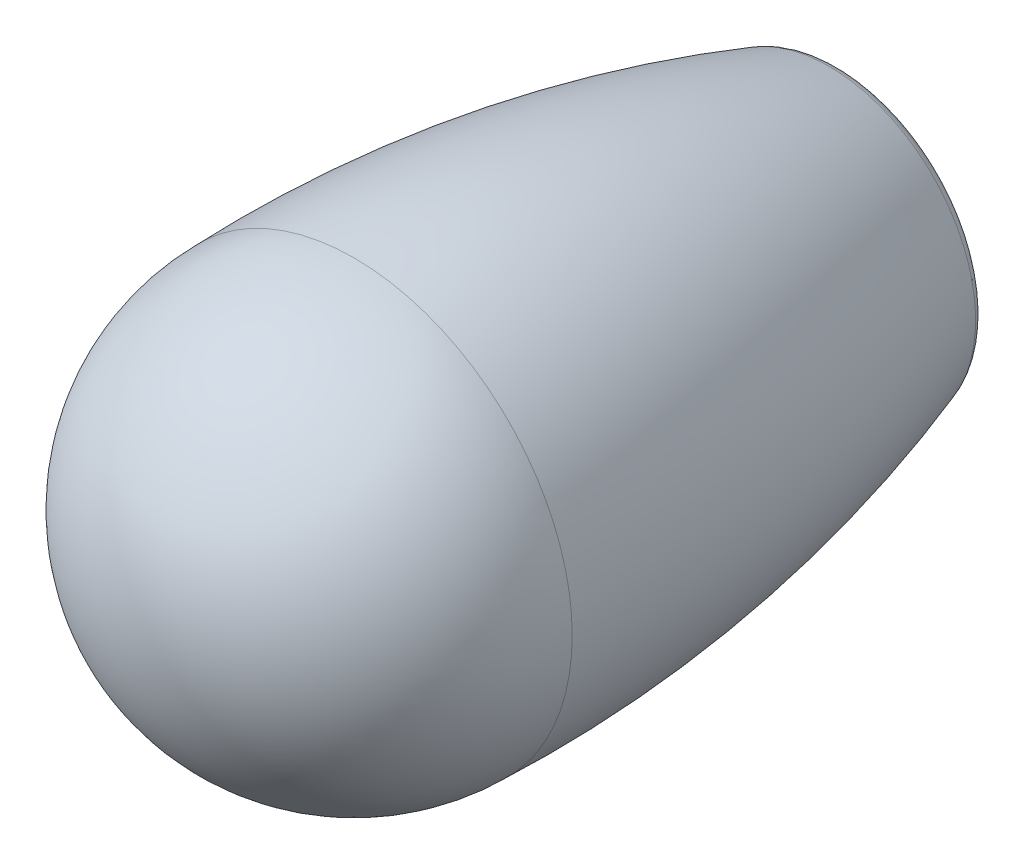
ISO-10303-21;
HEADER;
FILE_DESCRIPTION(('STEP AP214'),'2;1');
FILE_NAME('part.step','',(''),(''),'','','');
FILE_SCHEMA(('AUTOMOTIVE_DESIGN { 1 0 10303 214 1 1 1 1 }'));
ENDSEC;
DATA;
#1=APPLICATION_CONTEXT('core data for automotive mechanical design processes');
#2=APPLICATION_PROTOCOL_DEFINITION('international standard','automotive_design',2000,#1);
#3=PRODUCT_CONTEXT('',#1,'mechanical');
#4=PRODUCT('Part','Part','',(#3));
#5=PRODUCT_RELATED_PRODUCT_CATEGORY('part','',(#4));
#6=PRODUCT_DEFINITION_FORMATION('','',#4);
#7=PRODUCT_DEFINITION_CONTEXT('part definition',#1,'design');
#8=PRODUCT_DEFINITION('design','',#6,#7);
#9=PRODUCT_DEFINITION_SHAPE('','',#8);
#10=(LENGTH_UNIT() NAMED_UNIT(*) SI_UNIT(.MILLI.,.METRE.));
#11=(NAMED_UNIT(*) PLANE_ANGLE_UNIT() SI_UNIT($,.RADIAN.));
#12=(NAMED_UNIT(*) SI_UNIT($,.STERADIAN.) SOLID_ANGLE_UNIT());
#13=UNCERTAINTY_MEASURE_WITH_UNIT(LENGTH_MEASURE(1.E-05),#10,'distance_accuracy_value','');
#14=(GEOMETRIC_REPRESENTATION_CONTEXT(3) GLOBAL_UNCERTAINTY_ASSIGNED_CONTEXT((#13)) GLOBAL_UNIT_ASSIGNED_CONTEXT((#10,
#11,#12)) REPRESENTATION_CONTEXT('',''));
#15=CARTESIAN_POINT('',(0.,0.,0.));
#16=DIRECTION('',(0.,0.,1.));
#17=DIRECTION('',(1.,0.,0.));
#18=AXIS2_PLACEMENT_3D('',#15,#16,#17);
#19=CARTESIAN_POINT('',(0.,0.,29.));
#20=DIRECTION('',(0.,0.,-1.));
#21=DIRECTION('',(0.,1.,0.));
#22=AXIS2_PLACEMENT_3D('',#19,#20,#21);
#23=SPHERICAL_SURFACE('',#22,13.);
#24=CARTESIAN_POINT('',(0.,0.,28.9999999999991));
#25=DIRECTION('',(0.,0.,-1.));
#26=DIRECTION('',(0.,-1.,0.));
#27=AXIS2_PLACEMENT_3D('',#24,#25,#26);
#28=CIRCLE('',#27,13.);
#29=CARTESIAN_POINT('',(0.,-13.,28.9999999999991));
#30=VERTEX_POINT('',#29);
#31=EDGE_CURVE('E8',#30,#30,#28,.T.);
#32=ORIENTED_EDGE('',*,*,#31,.F.);
#33=EDGE_LOOP('',(#32));
#34=FACE_BOUND('',#33,.T.);
#35=ADVANCED_FACE('F12',(#34),#23,.T.);
#36=CARTESIAN_POINT('',(0.,0.,26.5588745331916));
#37=DIRECTION('',(0.,0.,-1.));
#38=DIRECTION('',(0.,-1.,0.));
#39=AXIS2_PLACEMENT_3D('',#36,#37,#38);
#40=DEGENERATE_TOROIDAL_SURFACE('',#39,66.9627469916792,80.,.F.);
#41=CARTESIAN_POINT('',(0.,0.,0.676469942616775));
#42=DIRECTION('',(0.,0.,-1.));
#43=DIRECTION('',(0.,-1.,0.));
#44=AXIS2_PLACEMENT_3D('',#41,#42,#43);
#45=CIRCLE('',#44,8.73468448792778);
#46=CARTESIAN_POINT('',(0.,-8.73468448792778,0.676469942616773));
#47=VERTEX_POINT('',#46);
#48=EDGE_CURVE('E18',#47,#47,#45,.T.);
#49=ORIENTED_EDGE('',*,*,#48,.F.);
#50=EDGE_LOOP('',(#49));
#51=FACE_BOUND('',#50,.T.);
#52=ORIENTED_EDGE('',*,*,#31,.T.);
#53=EDGE_LOOP('',(#52));
#54=FACE_BOUND('',#53,.T.);
#55=ADVANCED_FACE('F69',(#51,#54),#40,.F.);
#56=CARTESIAN_POINT('',(0.,0.,0.999999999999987));
#57=DIRECTION('',(0.,0.,-1.));
#58=DIRECTION('',(0.,-1.,0.));
#59=AXIS2_PLACEMENT_3D('',#56,#57,#58);
#60=TOROIDAL_SURFACE('',#59,7.78846659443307,0.99999999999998);
#61=CARTESIAN_POINT('',(0.,0.,0.));
#62=DIRECTION('',(0.,0.,-1.));
#63=DIRECTION('',(0.,-1.,0.));
#64=AXIS2_PLACEMENT_3D('',#61,#62,#63);
#65=CIRCLE('',#64,7.78846659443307);
#66=CARTESIAN_POINT('',(0.,-7.78846659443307,0.));
#67=VERTEX_POINT('',#66);
#68=EDGE_CURVE('E22',#67,#67,#65,.T.);
#69=ORIENTED_EDGE('',*,*,#68,.F.);
#70=EDGE_LOOP('',(#69));
#71=FACE_BOUND('',#70,.T.);
#72=ORIENTED_EDGE('',*,*,#48,.T.);
#73=EDGE_LOOP('',(#72));
#74=FACE_BOUND('',#73,.T.);
#75=ADVANCED_FACE('F64',(#71,#74),#60,.T.);
#76=CARTESIAN_POINT('',(0.,7.78846659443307,0.));
#77=DIRECTION('',(0.,0.,1.));
#78=DIRECTION('',(0.,1.,0.));
#79=AXIS2_PLACEMENT_3D('',#76,#77,#78);
#80=PLANE('',#79);
#81=CARTESIAN_POINT('',(0.,0.,0.));
#82=DIRECTION('',(0.,0.,-1.));
#83=DIRECTION('',(0.,-1.,0.));
#84=AXIS2_PLACEMENT_3D('',#81,#82,#83);
#85=CIRCLE('',#84,4.);
#86=CARTESIAN_POINT('',(0.,-4.,0.));
#87=VERTEX_POINT('',#86);
#88=EDGE_CURVE('E26',#87,#87,#85,.T.);
#89=ORIENTED_EDGE('',*,*,#88,.F.);
#90=EDGE_LOOP('',(#89));
#91=FACE_BOUND('',#90,.T.);
#92=ORIENTED_EDGE('',*,*,#68,.T.);
#93=EDGE_LOOP('',(#92));
#94=FACE_BOUND('',#93,.T.);
#95=ADVANCED_FACE('F58',(#91,#94),#80,.F.);
#96=CARTESIAN_POINT('',(0.,0.,-5.));
#97=DIRECTION('',(0.,0.,-1.));
#98=DIRECTION('',(0.,-1.,0.));
#99=AXIS2_PLACEMENT_3D('',#96,#97,#98);
#100=CYLINDRICAL_SURFACE('',#99,4.);
#101=CARTESIAN_POINT('',(0.,0.,25.));
#102=DIRECTION('',(0.,0.,-1.));
#103=DIRECTION('',(0.,-1.,0.));
#104=AXIS2_PLACEMENT_3D('',#101,#102,#103);
#105=CIRCLE('',#104,4.);
#106=CARTESIAN_POINT('',(0.,-4.00000000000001,25.));
#107=VERTEX_POINT('',#106);
#108=EDGE_CURVE('E31',#107,#107,#105,.T.);
#109=ORIENTED_EDGE('',*,*,#108,.F.);
#110=EDGE_LOOP('',(#109));
#111=FACE_BOUND('',#110,.T.);
#112=ORIENTED_EDGE('',*,*,#88,.T.);
#113=EDGE_LOOP('',(#112));
#114=FACE_BOUND('',#113,.T.);
#115=ADVANCED_FACE('F52',(#111,#114),#100,.F.);
#116=CARTESIAN_POINT('',(0.,4.,25.));
#117=DIRECTION('',(0.,0.,1.));
#118=DIRECTION('',(0.,1.,0.));
#119=AXIS2_PLACEMENT_3D('',#116,#117,#118);
#120=PLANE('',#119);
#121=CARTESIAN_POINT('',(0.,0.,25.));
#122=DIRECTION('',(0.,0.,-1.));
#123=DIRECTION('',(0.,1.,0.));
#124=AXIS2_PLACEMENT_3D('',#121,#122,#123);
#125=CIRCLE('',#124,3.);
#126=CARTESIAN_POINT('',(0.,2.99999999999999,25.));
#127=VERTEX_POINT('',#126);
#128=EDGE_CURVE('E35',#127,#127,#125,.T.);
#129=ORIENTED_EDGE('',*,*,#128,.F.);
#130=EDGE_LOOP('',(#129));
#131=FACE_BOUND('',#130,.T.);
#132=ORIENTED_EDGE('',*,*,#108,.T.);
#133=EDGE_LOOP('',(#132));
#134=FACE_BOUND('',#133,.T.);
#135=ADVANCED_FACE('F46',(#131,#134),#120,.F.);
#136=CARTESIAN_POINT('',(0.,0.,32.));
#137=DIRECTION('',(0.,0.,-1.));
#138=DIRECTION('',(0.,1.,0.));
#139=AXIS2_PLACEMENT_3D('',#136,#137,#138);
#140=CYLINDRICAL_SURFACE('',#139,3.);
#141=CARTESIAN_POINT('',(0.,0.,32.));
#142=DIRECTION('',(0.,0.,-1.));
#143=DIRECTION('',(0.,1.,0.));
#144=AXIS2_PLACEMENT_3D('',#141,#142,#143);
#145=CIRCLE('',#144,3.);
#146=CARTESIAN_POINT('',(0.,2.99999999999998,32.));
#147=VERTEX_POINT('',#146);
#148=EDGE_CURVE('E34',#147,#147,#145,.T.);
#149=ORIENTED_EDGE('',*,*,#148,.F.);
#150=EDGE_LOOP('',(#149));
#151=FACE_BOUND('',#150,.T.);
#152=ORIENTED_EDGE('',*,*,#128,.T.);
#153=EDGE_LOOP('',(#152));
#154=FACE_BOUND('',#153,.T.);
#155=ADVANCED_FACE('F43',(#151,#154),#140,.F.);
#156=CARTESIAN_POINT('',(0.,0.,32.));
#157=DIRECTION('',(0.,0.,-1.));
#158=DIRECTION('',(0.,1.,0.));
#159=AXIS2_PLACEMENT_3D('',#156,#157,#158);
#160=PLANE('',#159);
#161=ORIENTED_EDGE('',*,*,#148,.T.);
#162=EDGE_LOOP('',(#161));
#163=FACE_BOUND('',#162,.T.);
#164=ADVANCED_FACE('F41',(#163),#160,.T.);
#165=CLOSED_SHELL('',(#35,#55,#75,#95,#115,#135,#155,#164));
#166=MANIFOLD_SOLID_BREP('B1',#165);
#167=ADVANCED_BREP_SHAPE_REPRESENTATION('',(#18,#166),#14);
#168=SHAPE_DEFINITION_REPRESENTATION(#9,#167);
ENDSEC;
END-ISO-10303-21;
